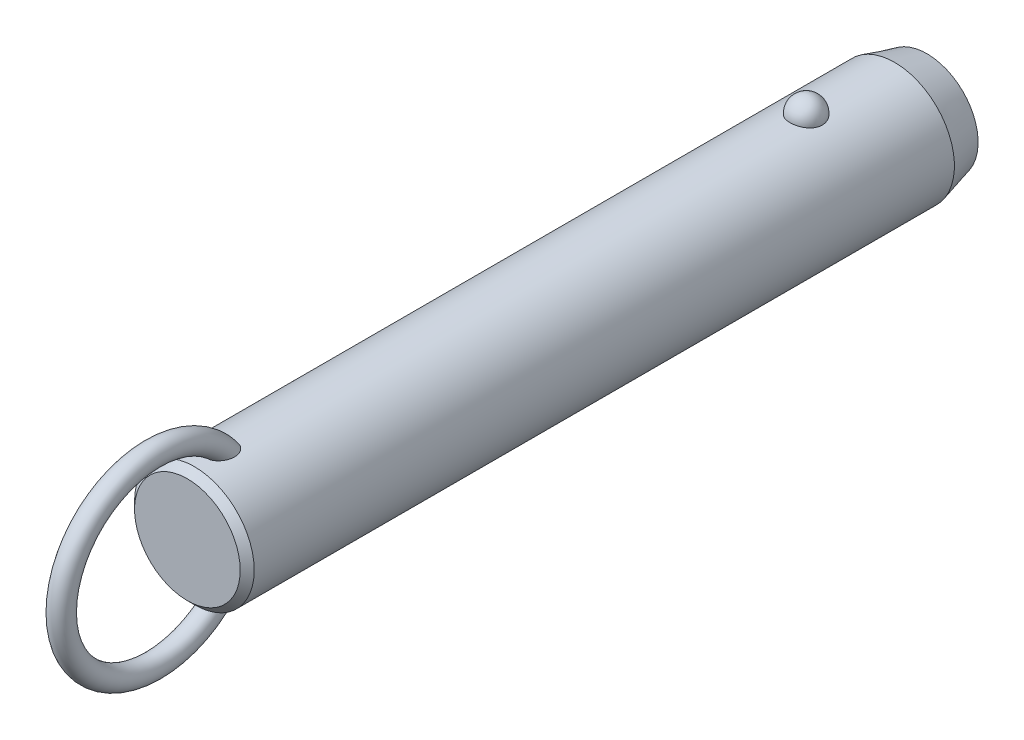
ISO-10303-21;
HEADER;
FILE_DESCRIPTION(('STEP AP214'),'2;1');
FILE_NAME('part.step','',(''),(''),'','','');
FILE_SCHEMA(('AUTOMOTIVE_DESIGN { 1 0 10303 214 1 1 1 1 }'));
ENDSEC;
DATA;
#1=APPLICATION_CONTEXT('core data for automotive mechanical design processes');
#2=APPLICATION_PROTOCOL_DEFINITION('international standard','automotive_design',2000,#1);
#3=PRODUCT_CONTEXT('',#1,'mechanical');
#4=PRODUCT('Part','Part','',(#3));
#5=PRODUCT_RELATED_PRODUCT_CATEGORY('part','',(#4));
#6=PRODUCT_DEFINITION_FORMATION('','',#4);
#7=PRODUCT_DEFINITION_CONTEXT('part definition',#1,'design');
#8=PRODUCT_DEFINITION('design','',#6,#7);
#9=PRODUCT_DEFINITION_SHAPE('','',#8);
#10=(LENGTH_UNIT() NAMED_UNIT(*) SI_UNIT(.MILLI.,.METRE.));
#11=(NAMED_UNIT(*) PLANE_ANGLE_UNIT() SI_UNIT($,.RADIAN.));
#12=(NAMED_UNIT(*) SI_UNIT($,.STERADIAN.) SOLID_ANGLE_UNIT());
#13=UNCERTAINTY_MEASURE_WITH_UNIT(LENGTH_MEASURE(1.E-05),#10,'distance_accuracy_value','');
#14=(GEOMETRIC_REPRESENTATION_CONTEXT(3) GLOBAL_UNCERTAINTY_ASSIGNED_CONTEXT((#13)) GLOBAL_UNIT_ASSIGNED_CONTEXT((#10,
#11,#12)) REPRESENTATION_CONTEXT('',''));
#15=CARTESIAN_POINT('',(0.,0.,0.));
#16=DIRECTION('',(0.,0.,1.));
#17=DIRECTION('',(1.,0.,0.));
#18=AXIS2_PLACEMENT_3D('',#15,#16,#17);
#19=CARTESIAN_POINT('',(0.,0.,99.1));
#20=DIRECTION('',(0.,0.,-1.));
#21=DIRECTION('',(-1.,0.,0.));
#22=AXIS2_PLACEMENT_3D('',#19,#20,#21);
#23=CYLINDRICAL_SURFACE('',#22,11.1);
#24=CARTESIAN_POINT('',(2.9724815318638,10.6945945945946,-3.));
#25=CARTESIAN_POINT('',(2.97247830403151,10.6945972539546,-2.83225059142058));
#26=CARTESIAN_POINT('',(2.95876598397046,10.6984356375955,-2.66445972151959));
#27=CARTESIAN_POINT('',(2.90424529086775,10.7133624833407,-2.33362381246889));
#28=CARTESIAN_POINT('',(2.8634252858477,10.7244540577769,-2.1705808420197));
#29=CARTESIAN_POINT('',(2.75573657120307,10.7526272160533,-1.85396767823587));
#30=CARTESIAN_POINT('',(2.68887937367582,10.7697061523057,-1.70039333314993));
#31=CARTESIAN_POINT('',(2.53079696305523,10.8079438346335,-1.40691598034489));
#32=CARTESIAN_POINT('',(2.43957264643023,10.8291024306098,-1.2670124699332));
#33=CARTESIAN_POINT('',(2.23458150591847,10.8732541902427,-1.00409565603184));
#34=CARTESIAN_POINT('',(2.12071295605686,10.8962553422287,-0.881162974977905));
#35=CARTESIAN_POINT('',(1.87365402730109,10.9414421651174,-0.656352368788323));
#36=CARTESIAN_POINT('',(1.74046358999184,10.9636278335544,-0.554474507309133));
#37=CARTESIAN_POINT('',(1.45872188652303,11.0046495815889,-0.374872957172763));
#38=CARTESIAN_POINT('',(1.31021276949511,11.0234944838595,-0.297085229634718));
#39=CARTESIAN_POINT('',(1.00170030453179,11.0557957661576,-0.167529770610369));
#40=CARTESIAN_POINT('',(0.841698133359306,11.0692526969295,-0.115759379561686));
#41=CARTESIAN_POINT('',(0.517607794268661,11.0890932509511,-0.0403925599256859));
#42=CARTESIAN_POINT('',(0.353633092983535,11.0955916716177,-0.0163383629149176));
#43=CARTESIAN_POINT('',(0.0238420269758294,11.1011989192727,0.0044517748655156));
#44=CARTESIAN_POINT('',(-0.141974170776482,11.1003084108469,0.00119017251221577));
#45=CARTESIAN_POINT('',(-0.468405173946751,11.0912990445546,-0.0323233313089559));
#46=CARTESIAN_POINT('',(-0.629059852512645,11.0832767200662,-0.0622147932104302));
#47=CARTESIAN_POINT('',(-0.942937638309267,11.0609962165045,-0.147645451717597));
#48=CARTESIAN_POINT('',(-1.09616062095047,11.0467379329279,-0.203185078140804));
#49=CARTESIAN_POINT('',(-1.39181061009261,11.0134071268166,-0.3387529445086));
#50=CARTESIAN_POINT('',(-1.53417383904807,10.9943086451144,-0.418913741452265));
#51=CARTESIAN_POINT('',(-1.80342160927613,10.9533667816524,-0.60144882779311));
#52=CARTESIAN_POINT('',(-1.9303046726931,10.9315231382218,-0.703825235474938));
#53=CARTESIAN_POINT('',(-2.16747598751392,10.887005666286,-0.930091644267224));
#54=CARTESIAN_POINT('',(-2.27742774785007,10.8643239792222,-1.05433291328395));
#55=CARTESIAN_POINT('',(-2.47517316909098,10.8209886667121,-1.31966633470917));
#56=CARTESIAN_POINT('',(-2.56296538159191,10.8003351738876,-1.46075958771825));
#57=CARTESIAN_POINT('',(-2.71500300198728,10.7631304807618,-1.75753646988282));
#58=CARTESIAN_POINT('',(-2.77898901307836,10.7466250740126,-1.91335887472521));
#59=CARTESIAN_POINT('',(-2.88046189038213,10.7198747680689,-2.2339152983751));
#60=CARTESIAN_POINT('',(-2.91794947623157,10.709629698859,-2.39864907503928));
#61=CARTESIAN_POINT('',(-2.96537819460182,10.6965949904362,-2.73165170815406));
#62=CARTESIAN_POINT('',(-2.97542891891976,10.693775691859,-2.89990378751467));
#63=CARTESIAN_POINT('',(-2.96804271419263,10.6958279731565,-3.235752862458));
#64=CARTESIAN_POINT('',(-2.95060646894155,10.7006993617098,-3.40334987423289));
#65=CARTESIAN_POINT('',(-2.88883358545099,10.71753912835,-3.73233906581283));
#66=CARTESIAN_POINT('',(-2.84462026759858,10.7294749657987,-3.89375610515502));
#67=CARTESIAN_POINT('',(-2.73050447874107,10.7590797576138,-4.20667949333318));
#68=CARTESIAN_POINT('',(-2.66060103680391,10.7767489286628,-4.35818546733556));
#69=CARTESIAN_POINT('',(-2.49642559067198,10.8159599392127,-4.6478542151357));
#70=CARTESIAN_POINT('',(-2.40203047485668,10.8375211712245,-4.78594458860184));
#71=CARTESIAN_POINT('',(-2.19143488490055,10.8820570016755,-5.0441038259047));
#72=CARTESIAN_POINT('',(-2.07523364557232,10.9050316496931,-5.16417205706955));
#73=CARTESIAN_POINT('',(-1.82361254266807,10.9499219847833,-5.38334833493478));
#74=CARTESIAN_POINT('',(-1.68812945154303,10.9718338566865,-5.48238464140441));
#75=CARTESIAN_POINT('',(-1.40191298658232,11.0120611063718,-5.65618873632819));
#76=CARTESIAN_POINT('',(-1.25118062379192,11.0303767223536,-5.73095813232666));
#77=CARTESIAN_POINT('',(-0.940570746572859,11.0611653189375,-5.85334725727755));
#78=CARTESIAN_POINT('',(-0.780821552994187,11.0737044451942,-5.90127578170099));
#79=CARTESIAN_POINT('',(-0.455204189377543,11.0918598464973,-5.96992976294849));
#80=CARTESIAN_POINT('',(-0.289336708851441,11.0974768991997,-5.99065827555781));
#81=CARTESIAN_POINT('',(0.0406846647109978,11.1011307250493,-6.00418773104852));
#82=CARTESIAN_POINT('',(0.204817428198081,11.099299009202,-5.99747318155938));
#83=CARTESIAN_POINT('',(0.5295530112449,11.088551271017,-5.9574031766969));
#84=CARTESIAN_POINT('',(0.69015594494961,11.0796354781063,-5.92404858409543));
#85=CARTESIAN_POINT('',(1.0027760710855,11.0557204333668,-5.83180084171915));
#86=CARTESIAN_POINT('',(1.15482001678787,11.0407414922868,-5.77299291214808));
#87=CARTESIAN_POINT('',(1.44678373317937,11.0062913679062,-5.63147366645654));
#88=CARTESIAN_POINT('',(1.58670279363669,10.9868199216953,-5.54876095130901));
#89=CARTESIAN_POINT('',(1.8527023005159,10.9451315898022,-5.36027644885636));
#90=CARTESIAN_POINT('',(1.97855158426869,10.9228788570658,-5.25418644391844));
#91=CARTESIAN_POINT('',(2.21080872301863,10.8782509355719,-5.02251354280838));
#92=CARTESIAN_POINT('',(2.31721312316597,10.8558757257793,-4.89692718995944));
#93=CARTESIAN_POINT('',(2.5094551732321,10.8130715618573,-4.62745408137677));
#94=CARTESIAN_POINT('',(2.59493284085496,10.7926798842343,-4.48330448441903));
#95=CARTESIAN_POINT('',(2.740862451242,10.7565495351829,-4.18236358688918));
#96=CARTESIAN_POINT('',(2.80132490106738,10.7408089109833,-4.02557762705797));
#97=CARTESIAN_POINT('',(2.88959070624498,10.7173718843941,-3.72475308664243));
#98=CARTESIAN_POINT('',(2.92062102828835,10.7088950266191,-3.58171216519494));
#99=CARTESIAN_POINT('',(2.96206765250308,10.6975052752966,-3.29245795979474));
#100=CARTESIAN_POINT('',(2.97248434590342,10.6945922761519,-3.14624473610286));
#101=CARTESIAN_POINT('',(2.9724815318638,10.6945945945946,-3.));
#102=B_SPLINE_CURVE_WITH_KNOTS('',3,(#24,#25,#26,#27,#28,#29,#30,#31,#32,#33,#34,#35,#36,#37,
#38,#39,#40,#41,#42,#43,#44,#45,#46,#47,#48,#49,#50,#51,#52,#53,#54,#55,#56,#57,#58,#59,#60,#61,
#62,#63,#64,#65,#66,#67,#68,#69,#70,#71,#72,#73,#74,#75,#76,#77,#78,#79,#80,#81,#82,#83,#84,#85,
#86,#87,#88,#89,#90,#91,#92,#93,#94,#95,#96,#97,#98,#99,#100,#101),.UNSPECIFIED.,.T.,.F.,(4,2,2,
2,2,2,2,2,2,2,2,2,2,2,2,2,2,2,2,2,2,2,2,2,2,2,2,2,2,2,2,2,2,2,2,2,2,2,4),(0.,0.502722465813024,
1.00566079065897,1.5083769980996,2.01107471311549,2.51608392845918,3.02109467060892,
3.52475118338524,4.02835620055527,4.523518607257,5.0186364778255,5.50715297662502,
5.9956776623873,6.48688002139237,6.97812923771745,7.47814366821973,7.9781907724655,
8.48353712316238,8.9888697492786,9.49218093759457,9.99547960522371,10.4964777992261,
10.997494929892,11.5010810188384,12.0046847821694,12.5099796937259,13.0152411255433,
13.5145635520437,14.0138298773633,14.5043200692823,14.9947943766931,15.4836390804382,
15.9725123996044,16.4685040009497,16.9645836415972,17.4686765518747,17.972557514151,
18.410841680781,18.849117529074),.UNSPECIFIED.);
#103=CARTESIAN_POINT('',(2.9724815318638,10.6945945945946,-3.));
#104=VERTEX_POINT('',#103);
#105=EDGE_CURVE('E41',#104,#104,#102,.T.);
#106=ORIENTED_EDGE('',*,*,#105,.T.);
#107=EDGE_LOOP('',(#106));
#108=FACE_BOUND('',#107,.T.);
#109=CARTESIAN_POINT('',(0.,0.,110.5));
#110=DIRECTION('',(0.,0.,1.));
#111=DIRECTION('',(1.,0.,0.));
#112=AXIS2_PLACEMENT_3D('',#109,#110,#111);
#113=CIRCLE('',#112,11.1);
#114=CARTESIAN_POINT('',(11.1,0.,110.5));
#115=VERTEX_POINT('',#114);
#116=EDGE_CURVE('E10',#115,#115,#113,.F.);
#117=ORIENTED_EDGE('',*,*,#116,.T.);
#118=EDGE_LOOP('',(#117));
#119=FACE_BOUND('',#118,.T.);
#120=CARTESIAN_POINT('',(-0.564520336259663,-11.0856356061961,102.757815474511));
#121=CARTESIAN_POINT('',(-0.667202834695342,-11.0804062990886,102.791283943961));
#122=CARTESIAN_POINT('',(-0.766875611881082,-11.0738877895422,102.833835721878));
#123=CARTESIAN_POINT('',(-0.957284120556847,-11.0590576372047,102.935419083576));
#124=CARTESIAN_POINT('',(-1.04801616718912,-11.0507452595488,102.99445742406));
#125=CARTESIAN_POINT('',(-1.21800952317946,-11.0333016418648,103.126529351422));
#126=CARTESIAN_POINT('',(-1.29730805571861,-11.0241732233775,103.199515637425));
#127=CARTESIAN_POINT('',(-1.44337665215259,-11.0060026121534,103.357037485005));
#128=CARTESIAN_POINT('',(-1.51014622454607,-10.9969604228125,103.441573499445));
#129=CARTESIAN_POINT('',(-1.63454620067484,-10.9791841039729,103.625521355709));
#130=CARTESIAN_POINT('',(-1.69127003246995,-10.9705107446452,103.725549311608));
#131=CARTESIAN_POINT('',(-1.78980785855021,-10.9548648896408,103.932790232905));
#132=CARTESIAN_POINT('',(-1.83161214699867,-10.9478935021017,104.040007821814));
#133=CARTESIAN_POINT('',(-1.91557028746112,-10.9335803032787,104.305408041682));
#134=CARTESIAN_POINT('',(-1.95040620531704,-10.9273269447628,104.465980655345));
#135=CARTESIAN_POINT('',(-1.99388326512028,-10.9194709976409,104.790697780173));
#136=CARTESIAN_POINT('',(-2.00248051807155,-10.9178762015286,104.954847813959));
#137=CARTESIAN_POINT('',(-1.99551615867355,-10.9191578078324,105.324650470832));
#138=CARTESIAN_POINT('',(-1.9732206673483,-10.9232807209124,105.530191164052));
#139=CARTESIAN_POINT('',(-1.91529761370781,-10.9335244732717,105.833595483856));
#140=CARTESIAN_POINT('',(-1.8918457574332,-10.9376266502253,105.934088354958));
#141=CARTESIAN_POINT('',(-1.83700674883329,-10.9469720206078,106.132855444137));
#142=CARTESIAN_POINT('',(-1.80562070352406,-10.9522150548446,106.231129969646));
#143=CARTESIAN_POINT('',(-1.73463055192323,-10.9636837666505,106.425914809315));
#144=CARTESIAN_POINT('',(-1.69493416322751,-10.9699202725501,106.522390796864));
#145=CARTESIAN_POINT('',(-1.60745141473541,-10.9830806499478,106.711626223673));
#146=CARTESIAN_POINT('',(-1.55966150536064,-10.9900048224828,106.804384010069));
#147=CARTESIAN_POINT('',(-1.45591812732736,-11.0042280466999,106.984690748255));
#148=CARTESIAN_POINT('',(-1.40000013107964,-11.0115253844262,107.072260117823));
#149=CARTESIAN_POINT('',(-1.27937470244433,-11.0261911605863,107.241029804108));
#150=CARTESIAN_POINT('',(-1.21467835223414,-11.0335594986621,107.32223795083));
#151=CARTESIAN_POINT('',(-1.08218150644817,-11.0473027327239,107.469001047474));
#152=CARTESIAN_POINT('',(-1.01522633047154,-11.0537063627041,107.535309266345));
#153=CARTESIAN_POINT('',(-0.87295215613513,-11.065850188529,107.658378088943));
#154=CARTESIAN_POINT('',(-0.797642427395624,-11.0715911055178,107.715149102));
#155=CARTESIAN_POINT('',(-0.651396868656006,-11.081071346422,107.807515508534));
#156=CARTESIAN_POINT('',(-0.581712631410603,-11.0849841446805,107.845049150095));
#157=CARTESIAN_POINT('',(-0.437066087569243,-11.0916271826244,107.908259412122));
#158=CARTESIAN_POINT('',(-0.362109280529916,-11.0943586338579,107.933948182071));
#159=CARTESIAN_POINT('',(-0.207828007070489,-11.0983242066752,107.971117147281));
#160=CARTESIAN_POINT('',(-0.128467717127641,-11.0995432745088,107.982454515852));
#161=CARTESIAN_POINT('',(0.0309101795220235,-11.1002423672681,107.988965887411));
#162=CARTESIAN_POINT('',(0.110927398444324,-11.0997233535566,107.984148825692));
#163=CARTESIAN_POINT('',(0.256406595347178,-11.097240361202,107.960959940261));
#164=CARTESIAN_POINT('',(0.32223577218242,-11.0955074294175,107.944754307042));
#165=CARTESIAN_POINT('',(0.450635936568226,-11.0910350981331,107.902600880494));
#166=CARTESIAN_POINT('',(0.513205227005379,-11.0882951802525,107.876648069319));
#167=CARTESIAN_POINT('',(0.662626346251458,-11.0805620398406,107.802607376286));
#168=CARTESIAN_POINT('',(0.747127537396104,-11.0751144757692,107.749845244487));
#169=CARTESIAN_POINT('',(0.906756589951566,-11.0631932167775,107.631720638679));
#170=CARTESIAN_POINT('',(0.981859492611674,-11.0567168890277,107.566325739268));
#171=CARTESIAN_POINT('',(1.10712207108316,-11.0447856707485,107.44226337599));
#172=CARTESIAN_POINT('',(1.15909566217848,-11.0394280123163,107.385383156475));
#173=CARTESIAN_POINT('',(1.25791923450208,-11.0286040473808,107.267327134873));
#174=CARTESIAN_POINT('',(1.30476642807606,-11.0231376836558,107.206149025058));
#175=CARTESIAN_POINT('',(1.43818612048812,-11.0068027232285,107.017305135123));
#176=CARTESIAN_POINT('',(1.51751767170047,-10.9960104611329,106.884453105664));
#177=CARTESIAN_POINT('',(1.63597546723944,-10.9788847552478,106.653137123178));
#178=CARTESIAN_POINT('',(1.67988876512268,-10.9722190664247,106.557053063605));
#179=CARTESIAN_POINT('',(1.75953241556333,-10.9597298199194,106.361431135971));
#180=CARTESIAN_POINT('',(1.79525967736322,-10.9539065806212,106.261891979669));
#181=CARTESIAN_POINT('',(1.85844731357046,-10.9433632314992,106.06021118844));
#182=CARTESIAN_POINT('',(1.88591073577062,-10.9386427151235,105.95807052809));
#183=CARTESIAN_POINT('',(1.93234324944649,-10.9305350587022,105.751819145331));
#184=CARTESIAN_POINT('',(1.95131065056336,-10.9271481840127,105.647708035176));
#185=CARTESIAN_POINT('',(1.99040203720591,-10.9201183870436,105.365458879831));
#186=CARTESIAN_POINT('',(2.00221217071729,-10.9179256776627,105.186037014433));
#187=CARTESIAN_POINT('',(1.99711676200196,-10.9188636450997,104.827713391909));
#188=CARTESIAN_POINT('',(1.98026150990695,-10.9219849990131,104.648811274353));
#189=CARTESIAN_POINT('',(1.92151657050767,-10.9324473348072,104.33645144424));
#190=CARTESIAN_POINT('',(1.88605081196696,-10.9386915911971,104.201759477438));
#191=CARTESIAN_POINT('',(1.7939302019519,-10.9541780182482,103.939966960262));
#192=CARTESIAN_POINT('',(1.73729868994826,-10.9634168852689,103.812858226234));
#193=CARTESIAN_POINT('',(1.612370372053,-10.9824218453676,103.589418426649));
#194=CARTESIAN_POINT('',(1.54715374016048,-10.9918945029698,103.491345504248));
#195=CARTESIAN_POINT('',(1.40127026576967,-11.0114415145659,103.307434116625));
#196=CARTESIAN_POINT('',(1.32060742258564,-11.0215157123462,103.221592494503));
#197=CARTESIAN_POINT('',(1.14474787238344,-11.041168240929,103.065163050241));
#198=CARTESIAN_POINT('',(1.04947805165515,-11.0507437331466,102.994656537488));
#199=CARTESIAN_POINT('',(0.847278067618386,-11.0680789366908,102.872640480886));
#200=CARTESIAN_POINT('',(0.74035174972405,-11.0758392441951,102.821124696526));
#201=CARTESIAN_POINT('',(0.529289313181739,-11.0878275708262,102.743485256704));
#202=CARTESIAN_POINT('',(0.425895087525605,-11.0923259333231,102.715377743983));
#203=CARTESIAN_POINT('',(0.215723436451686,-11.0984001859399,102.677703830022));
#204=CARTESIAN_POINT('',(0.108947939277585,-11.0999777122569,102.668127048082));
#205=CARTESIAN_POINT('',(-0.0938962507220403,-11.1000196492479,102.667877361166));
#206=CARTESIAN_POINT('',(-0.189967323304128,-11.0987797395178,102.675408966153));
#207=CARTESIAN_POINT('',(-0.379657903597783,-11.0939111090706,102.705507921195));
#208=CARTESIAN_POINT('',(-0.473277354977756,-11.0902823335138,102.728075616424));
#209=CARTESIAN_POINT('',(-0.564520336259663,-11.0856356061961,102.757815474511));
#210=B_SPLINE_CURVE_WITH_KNOTS('',3,(#120,#121,#122,#123,#124,#125,#126,#127,#128,#129,#130,
#131,#132,#133,#134,#135,#136,#137,#138,#139,#140,#141,#142,#143,#144,#145,#146,#147,#148,#149,
#150,#151,#152,#153,#154,#155,#156,#157,#158,#159,#160,#161,#162,#163,#164,#165,#166,#167,#168,
#169,#170,#171,#172,#173,#174,#175,#176,#177,#178,#179,#180,#181,#182,#183,#184,#185,#186,#187,
#188,#189,#190,#191,#192,#193,#194,#195,#196,#197,#198,#199,#200,#201,#202,#203,#204,#205,#206,
#207,#208,#209),.UNSPECIFIED.,.T.,.F.,(4,2,2,2,2,2,2,2,2,2,2,2,2,2,2,2,2,2,2,2,2,2,2,2,2,2,2,2,
2,2,2,2,2,2,2,2,2,2,2,2,2,2,2,2,4),(0.,0.323999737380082,0.648132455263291,0.971184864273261,
1.29424994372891,1.63886237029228,1.98369857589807,2.47426059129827,2.96564271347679,
3.58257396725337,3.89215258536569,4.20168803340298,4.51486273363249,4.82817514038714,
5.14015911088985,5.45175282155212,5.73442856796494,6.01679375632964,6.25364580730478,
6.49025437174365,6.7291996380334,6.96801276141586,7.17061258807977,7.37331685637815,
7.67094989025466,7.96935728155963,8.2007506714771,8.43226927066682,8.89581623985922,
9.21306533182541,9.53043400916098,9.84768549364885,10.1650000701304,10.70229304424,
11.2386443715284,11.6553390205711,12.0715755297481,12.4245637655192,12.7774607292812,
13.1321855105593,13.4867936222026,13.8068771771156,14.1267813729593,14.4146787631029,
14.7025827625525),.UNSPECIFIED.);
#211=CARTESIAN_POINT('',(-0.564520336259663,-11.0856356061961,102.757815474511));
#212=VERTEX_POINT('',#211);
#213=EDGE_CURVE('E60',#212,#212,#210,.T.);
#214=ORIENTED_EDGE('',*,*,#213,.T.);
#215=EDGE_LOOP('',(#214));
#216=FACE_BOUND('',#215,.T.);
#217=CARTESIAN_POINT('',(-0.564520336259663,11.0856356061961,102.757815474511));
#218=CARTESIAN_POINT('',(-0.468542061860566,11.0905203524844,102.726545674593));
#219=CARTESIAN_POINT('',(-0.36979381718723,11.0942886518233,102.703157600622));
#220=CARTESIAN_POINT('',(-0.169555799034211,11.0991586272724,102.673085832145));
#221=CARTESIAN_POINT('',(-0.0680604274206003,11.1002543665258,102.66643932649));
#222=CARTESIAN_POINT('',(0.134549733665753,11.099646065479,102.670157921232));
#223=CARTESIAN_POINT('',(0.235664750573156,11.0979441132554,102.68051033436));
#224=CARTESIAN_POINT('',(0.43463240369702,11.0919342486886,102.717831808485));
#225=CARTESIAN_POINT('',(0.532486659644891,11.0876276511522,102.744792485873));
#226=CARTESIAN_POINT('',(0.722445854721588,11.0768742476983,102.8144096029));
#227=CARTESIAN_POINT('',(0.814543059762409,11.0704246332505,102.857086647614));
#228=CARTESIAN_POINT('',(0.99056508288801,11.0560659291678,102.956648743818));
#229=CARTESIAN_POINT('',(1.07448844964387,11.048156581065,103.013536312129));
#230=CARTESIAN_POINT('',(1.23562672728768,11.0313221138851,103.142210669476));
#231=CARTESIAN_POINT('',(1.31242684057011,11.0223686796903,103.214511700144));
#232=CARTESIAN_POINT('',(1.45398030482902,11.0045918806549,103.370042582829));
#233=CARTESIAN_POINT('',(1.51873073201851,10.9957685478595,103.453275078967));
#234=CARTESIAN_POINT('',(1.64107232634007,10.9782087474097,103.636384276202));
#235=CARTESIAN_POINT('',(1.69743176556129,10.9695572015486,103.737089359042));
#236=CARTESIAN_POINT('',(1.79515063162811,10.9539887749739,103.945626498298));
#237=CARTESIAN_POINT('',(1.83649966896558,10.9470730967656,104.05346343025));
#238=CARTESIAN_POINT('',(1.91931148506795,10.9329211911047,104.320399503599));
#239=CARTESIAN_POINT('',(1.9534010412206,10.9267904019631,104.481861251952));
#240=CARTESIAN_POINT('',(1.99526195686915,10.9192174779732,104.80821631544));
#241=CARTESIAN_POINT('',(2.00298989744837,10.9177830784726,104.97311484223));
#242=CARTESIAN_POINT('',(1.99396251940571,10.9194420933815,105.344100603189));
#243=CARTESIAN_POINT('',(1.97050829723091,10.923774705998,105.55003871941));
#244=CARTESIAN_POINT('',(1.91079643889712,10.9343131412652,105.853901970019));
#245=CARTESIAN_POINT('',(1.88673702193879,10.9385106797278,105.954529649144));
#246=CARTESIAN_POINT('',(1.83065508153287,10.9480376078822,106.153510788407));
#247=CARTESIAN_POINT('',(1.79863369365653,10.9533668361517,106.251864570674));
#248=CARTESIAN_POINT('',(1.72633365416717,10.9649954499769,106.446720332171));
#249=CARTESIAN_POINT('',(1.68596409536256,10.9713053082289,106.54318790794));
#250=CARTESIAN_POINT('',(1.59707998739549,10.9845964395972,106.732323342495));
#251=CARTESIAN_POINT('',(1.54856169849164,10.9915780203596,106.824989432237));
#252=CARTESIAN_POINT('',(1.44330168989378,11.0058935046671,107.004975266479));
#253=CARTESIAN_POINT('',(1.38659749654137,11.0132257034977,107.092316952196));
#254=CARTESIAN_POINT('',(1.26431158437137,11.0279330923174,107.260456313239));
#255=CARTESIAN_POINT('',(1.19874160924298,11.0353082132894,107.341262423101));
#256=CARTESIAN_POINT('',(1.06542088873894,11.0489310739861,107.485985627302));
#257=CARTESIAN_POINT('',(0.998640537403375,11.0552153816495,107.550784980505));
#258=CARTESIAN_POINT('',(0.856896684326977,11.0671032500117,107.670846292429));
#259=CARTESIAN_POINT('',(0.781942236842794,11.0727075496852,107.726118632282));
#260=CARTESIAN_POINT('',(0.636276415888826,11.081949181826,107.815972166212));
#261=CARTESIAN_POINT('',(0.566755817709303,11.0857572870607,107.852441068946));
#262=CARTESIAN_POINT('',(0.422602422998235,11.0921860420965,107.913533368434));
#263=CARTESIAN_POINT('',(0.347974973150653,11.0948079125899,107.938168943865));
#264=CARTESIAN_POINT('',(0.194593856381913,11.0985608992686,107.973323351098));
#265=CARTESIAN_POINT('',(0.115807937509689,11.0996777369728,107.983706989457));
#266=CARTESIAN_POINT('',(-0.0422499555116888,11.1002003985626,107.988574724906));
#267=CARTESIAN_POINT('',(-0.121521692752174,11.09960699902,107.983066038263));
#268=CARTESIAN_POINT('',(-0.266046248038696,11.0970123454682,107.958827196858));
#269=CARTESIAN_POINT('',(-0.331661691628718,11.0952283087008,107.942135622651));
#270=CARTESIAN_POINT('',(-0.459588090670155,11.0906663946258,107.899111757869));
#271=CARTESIAN_POINT('',(-0.521897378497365,11.0878880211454,107.872774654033));
#272=CARTESIAN_POINT('',(-0.671446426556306,11.0800342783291,107.797513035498));
#273=CARTESIAN_POINT('',(-0.756250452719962,11.0744969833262,107.743818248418));
#274=CARTESIAN_POINT('',(-0.916349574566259,11.0624045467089,107.623802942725));
#275=CARTESIAN_POINT('',(-0.99161892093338,11.0558467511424,107.557449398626));
#276=CARTESIAN_POINT('',(-1.11713140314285,11.0437783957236,107.431633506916));
#277=CARTESIAN_POINT('',(-1.16920539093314,11.0383619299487,107.373952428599));
#278=CARTESIAN_POINT('',(-1.26817476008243,11.02743010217,107.254280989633));
#279=CARTESIAN_POINT('',(-1.31506731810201,11.0219146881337,107.192288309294));
#280=CARTESIAN_POINT('',(-1.40399813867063,11.0109399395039,107.064784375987));
#281=CARTESIAN_POINT('',(-1.4460286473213,11.0054807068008,106.999267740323));
#282=CARTESIAN_POINT('',(-1.52538779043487,10.9947621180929,106.865422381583));
#283=CARTESIAN_POINT('',(-1.56271516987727,10.9895028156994,106.797092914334));
#284=CARTESIAN_POINT('',(-1.64537943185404,10.9774790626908,106.633210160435));
#285=CARTESIAN_POINT('',(-1.68879497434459,10.9708503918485,106.5366735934));
#286=CARTESIAN_POINT('',(-1.76740738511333,10.9584602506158,106.340236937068));
#287=CARTESIAN_POINT('',(-1.80260120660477,10.95269910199,106.240335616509));
#288=CARTESIAN_POINT('',(-1.86468657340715,10.9423003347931,106.037966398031));
#289=CARTESIAN_POINT('',(-1.89158164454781,10.9376622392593,105.935499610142));
#290=CARTESIAN_POINT('',(-1.93682458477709,10.9297405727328,105.728642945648));
#291=CARTESIAN_POINT('',(-1.9551708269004,10.9264572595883,105.624252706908));
#292=CARTESIAN_POINT('',(-1.99232562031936,10.9197647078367,105.34262876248));
#293=CARTESIAN_POINT('',(-2.00294603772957,10.9177914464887,105.164185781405));
#294=CARTESIAN_POINT('',(-1.99566675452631,10.9191290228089,104.807996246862));
#295=CARTESIAN_POINT('',(-1.97781651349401,10.9224306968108,104.63024902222));
#296=CARTESIAN_POINT('',(-1.91747214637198,10.9331592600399,104.319792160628));
#297=CARTESIAN_POINT('',(-1.88131022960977,10.9395108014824,104.185825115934));
#298=CARTESIAN_POINT('',(-1.78790380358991,10.9551659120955,103.92559757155));
#299=CARTESIAN_POINT('',(-1.7306830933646,10.9644661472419,103.799328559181));
#300=CARTESIAN_POINT('',(-1.60475573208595,10.9835398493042,103.57741565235));
#301=CARTESIAN_POINT('',(-1.53908879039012,10.9930297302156,103.480026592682));
#302=CARTESIAN_POINT('',(-1.39238608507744,11.0125708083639,103.297525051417));
#303=CARTESIAN_POINT('',(-1.31135150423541,11.0226219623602,103.212411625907));
#304=CARTESIAN_POINT('',(-1.14382035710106,11.0411991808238,103.06529943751));
#305=CARTESIAN_POINT('',(-1.05858500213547,11.0497792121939,103.00186930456));
#306=CARTESIAN_POINT('',(-0.878723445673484,11.0655285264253,102.890250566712));
#307=CARTESIAN_POINT('',(-0.784123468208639,11.0727015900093,102.842020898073));
#308=CARTESIAN_POINT('',(-0.646163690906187,11.0812501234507,102.786023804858));
#309=CARTESIAN_POINT('',(-0.605595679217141,11.0835451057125,102.771197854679));
#310=CARTESIAN_POINT('',(-0.564520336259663,11.0856356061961,102.757815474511));
#311=B_SPLINE_CURVE_WITH_KNOTS('',3,(#217,#218,#219,#220,#221,#222,#223,#224,#225,#226,#227,
#228,#229,#230,#231,#232,#233,#234,#235,#236,#237,#238,#239,#240,#241,#242,#243,#244,#245,#246,
#247,#248,#249,#250,#251,#252,#253,#254,#255,#256,#257,#258,#259,#260,#261,#262,#263,#264,#265,
#266,#267,#268,#269,#270,#271,#272,#273,#274,#275,#276,#277,#278,#279,#280,#281,#282,#283,#284,
#285,#286,#287,#288,#289,#290,#291,#292,#293,#294,#295,#296,#297,#298,#299,#300,#301,#302,#303,
#304,#305,#306,#307,#308,#309,#310),.UNSPECIFIED.,.T.,.F.,(4,2,2,2,2,2,2,2,2,2,2,2,2,2,2,2,2,2,
2,2,2,2,2,2,2,2,2,2,2,2,2,2,2,2,2,2,2,2,2,2,2,2,2,2,2,2,4),(0.,0.303061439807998,
0.606795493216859,0.910302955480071,1.21365733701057,1.51741085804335,1.82121821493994,
2.13745205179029,2.45376252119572,2.79958678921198,3.14564996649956,3.63832391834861,
4.13180893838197,4.75031912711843,5.06071926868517,5.37107516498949,5.68500772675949,
5.99908475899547,6.31176519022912,6.62403542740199,6.90315673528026,7.1819719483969,
7.41687778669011,7.65154134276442,7.88841587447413,8.12518286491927,8.3275284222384,
8.52997509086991,8.82986421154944,9.13054668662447,9.36393502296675,9.59744991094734,
9.83133221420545,10.0652767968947,10.383032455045,10.7009056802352,11.0186436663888,
11.3364420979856,11.8705925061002,12.4038159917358,12.8189662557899,13.2336487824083,
13.5857049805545,13.9377340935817,14.2561354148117,14.5736690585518,14.7033687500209),.UNSPECIFIED.);
#312=CARTESIAN_POINT('',(-0.564520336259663,11.0856356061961,102.757815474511));
#313=VERTEX_POINT('',#312);
#314=EDGE_CURVE('E67',#313,#313,#311,.T.);
#315=ORIENTED_EDGE('',*,*,#314,.T.);
#316=EDGE_LOOP('',(#315));
#317=FACE_BOUND('',#316,.T.);
#318=CARTESIAN_POINT('',(0.,0.,-19.4));
#319=DIRECTION('',(0.,0.,-1.));
#320=DIRECTION('',(-1.,0.,0.));
#321=AXIS2_PLACEMENT_3D('',#318,#319,#320);
#322=CIRCLE('',#321,11.1);
#323=CARTESIAN_POINT('',(-11.1,0.,-19.4));
#324=VERTEX_POINT('',#323);
#325=EDGE_CURVE('E57',#324,#324,#322,.F.);
#326=ORIENTED_EDGE('',*,*,#325,.T.);
#327=EDGE_LOOP('',(#326));
#328=FACE_BOUND('',#327,.T.);
#329=ADVANCED_FACE('F37',(#108,#119,#216,#317,#328),#23,.T.);
#330=CARTESIAN_POINT('',(0.,0.,-25.4));
#331=DIRECTION('',(0.,0.,-1.));
#332=DIRECTION('',(-1.,0.,0.));
#333=AXIS2_PLACEMENT_3D('',#330,#331,#332);
#334=PLANE('',#333);
#335=CARTESIAN_POINT('',(0.,0.,-25.4));
#336=DIRECTION('',(0.,0.,-1.));
#337=DIRECTION('',(-1.,0.,0.));
#338=AXIS2_PLACEMENT_3D('',#335,#336,#337);
#339=CIRCLE('',#338,9.49230484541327);
#340=CARTESIAN_POINT('',(-9.49230484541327,0.,-25.4));
#341=VERTEX_POINT('',#340);
#342=EDGE_CURVE('E66',#341,#341,#339,.T.);
#343=ORIENTED_EDGE('',*,*,#342,.T.);
#344=EDGE_LOOP('',(#343));
#345=FACE_BOUND('',#344,.T.);
#346=ADVANCED_FACE('F85',(#345),#334,.T.);
#347=CARTESIAN_POINT('',(0.,0.,-25.4));
#348=DIRECTION('',(0.,0.,1.));
#349=DIRECTION('',(1.,0.,0.));
#350=AXIS2_PLACEMENT_3D('',#347,#348,#349);
#351=CONICAL_SURFACE('',#350,9.49230484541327,0.261799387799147);
#352=ORIENTED_EDGE('',*,*,#325,.F.);
#353=EDGE_LOOP('',(#352));
#354=FACE_BOUND('',#353,.T.);
#355=ORIENTED_EDGE('',*,*,#342,.F.);
#356=EDGE_LOOP('',(#355));
#357=FACE_BOUND('',#356,.T.);
#358=ADVANCED_FACE('F83',(#354,#357),#351,.T.);
#359=CARTESIAN_POINT('',(0.,0.,111.8));
#360=DIRECTION('',(0.,0.,1.));
#361=DIRECTION('',(1.,0.,0.));
#362=AXIS2_PLACEMENT_3D('',#359,#360,#361);
#363=PLANE('',#362);
#364=CARTESIAN_POINT('',(0.,0.,111.8));
#365=DIRECTION('',(0.,0.,1.));
#366=DIRECTION('',(1.,0.,0.));
#367=AXIS2_PLACEMENT_3D('',#364,#365,#366);
#368=CIRCLE('',#367,9.79999999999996);
#369=CARTESIAN_POINT('',(9.79999999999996,0.,111.8));
#370=VERTEX_POINT('',#369);
#371=EDGE_CURVE('E50',#370,#370,#368,.T.);
#372=ORIENTED_EDGE('',*,*,#371,.T.);
#373=EDGE_LOOP('',(#372));
#374=FACE_BOUND('',#373,.T.);
#375=ADVANCED_FACE('F77',(#374),#363,.T.);
#376=CARTESIAN_POINT('',(0.,0.,118.15));
#377=DIRECTION('',(1.,0.,0.));
#378=DIRECTION('',(0.,0.,-1.));
#379=AXIS2_PLACEMENT_3D('',#376,#377,#378);
#380=TOROIDAL_SURFACE('',#379,17.05,2.);
#381=ORIENTED_EDGE('',*,*,#314,.F.);
#382=EDGE_LOOP('',(#381));
#383=FACE_BOUND('',#382,.T.);
#384=ORIENTED_EDGE('',*,*,#213,.F.);
#385=EDGE_LOOP('',(#384));
#386=FACE_BOUND('',#385,.T.);
#387=ADVANCED_FACE('F73',(#383,#386),#380,.T.);
#388=CARTESIAN_POINT('',(0.,0.,111.8));
#389=DIRECTION('',(0.,0.,-1.));
#390=DIRECTION('',(-1.,0.,0.));
#391=AXIS2_PLACEMENT_3D('',#388,#389,#390);
#392=CONICAL_SURFACE('',#391,9.79999999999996,0.785398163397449);
#393=ORIENTED_EDGE('',*,*,#116,.F.);
#394=EDGE_LOOP('',(#393));
#395=FACE_BOUND('',#394,.T.);
#396=ORIENTED_EDGE('',*,*,#371,.F.);
#397=EDGE_LOOP('',(#396));
#398=FACE_BOUND('',#397,.T.);
#399=ADVANCED_FACE('F39',(#395,#398),#392,.T.);
#400=CARTESIAN_POINT('',(0.,11.1,-3.));
#401=DIRECTION('',(0.,1.,0.));
#402=DIRECTION('',(0.,0.,-1.));
#403=AXIS2_PLACEMENT_3D('',#400,#401,#402);
#404=SPHERICAL_SURFACE('',#403,3.);
#405=ORIENTED_EDGE('',*,*,#105,.F.);
#406=EDGE_LOOP('',(#405));
#407=FACE_BOUND('',#406,.T.);
#408=ADVANCED_FACE('F79',(#407),#404,.T.);
#409=CLOSED_SHELL('',(#329,#346,#358,#375,#387,#399,#408));
#410=MANIFOLD_SOLID_BREP('B2',#409);
#411=ADVANCED_BREP_SHAPE_REPRESENTATION('',(#18,#410),#14);
#412=SHAPE_DEFINITION_REPRESENTATION(#9,#411);
ENDSEC;
END-ISO-10303-21;
